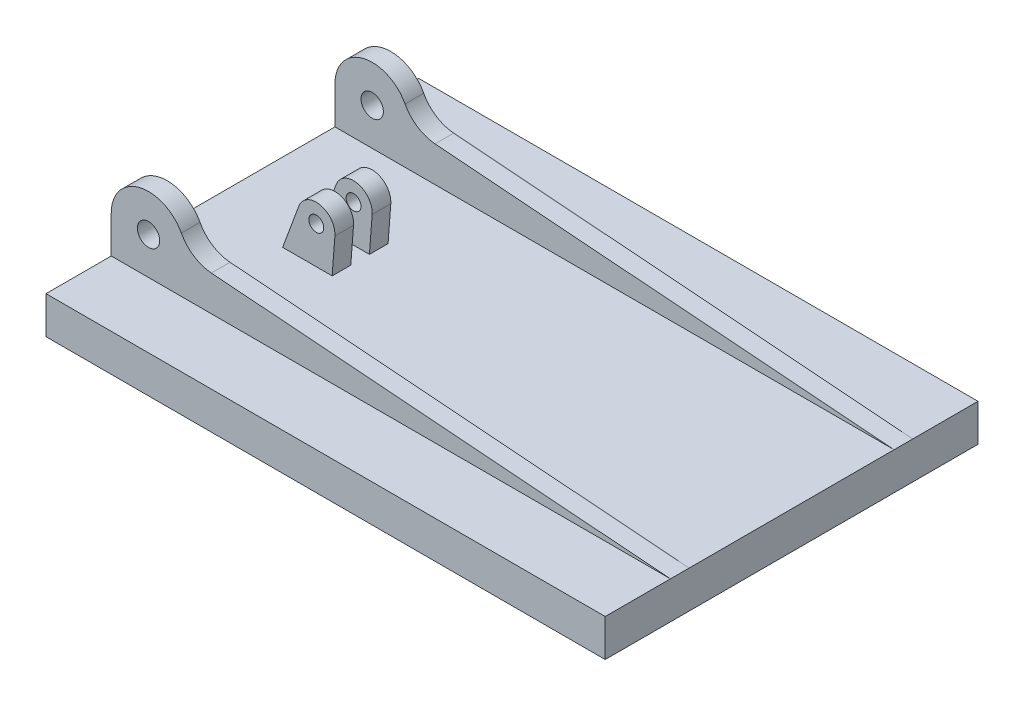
from build123d import *

# Parameters (mm, degrees)
ESQUISSE1_W             = 1500
ESQUISSE1_H             = 1000
BOSS_EXTRU_1_DEPTH      = 100
BOSS_EXTRU_2_DEPTH      = 25
ESQUISSE3_R             = 30
ENL_V_MAT_EXTRU_1_DEPTH = 1724.550115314
CONG_1_R                = 100
ESQUISSE4_R             = 20
BOSS_EXTRU_3_DEPTH      = 25


with BuildPart() as part:
    # Esquisse1 → Boss.-Extru.1 (new body)
    with BuildSketch(Plane(origin=(0, 0, 0), x_dir=(1, 0, 0), z_dir=(0, 1, 0))):
        with Locations((750, 0)):
            Rectangle(ESQUISSE1_W, ESQUISSE1_H)
    extrude(amount=-BOSS_EXTRU_1_DEPTH)

    # Esquisse2 → Boss.-Extru.2 (add, symmetric)
    with BuildSketch(Plane.XY.offset(-300)):
        with BuildLine():
            Line((0, 100), (0, 0))
            Line((0, 0), (1500, 0))
            Line((1500, 0), (200, 100))
            ThreePointArc((200, 100), (100, 200), (0, 100))
        make_face()
    boss_extru_2 = extrude(amount=BOSS_EXTRU_2_DEPTH, both=True)

    # Sym_trie1: Boss.-Extru.2 across plane
    add(boss_extru_2.mirror(Plane.XY))

    # Esquisse3 → Enl_v. mat.-Extru.1 (cut, through all)
    with BuildSketch(Plane.XY.offset(325)):
        with Locations((100, 100)):
            Circle(ESQUISSE3_R)
    extrude(amount=-ENL_V_MAT_EXTRU_1_DEPTH, mode=Mode.SUBTRACT)

    # Cong_1
    cong_1_edges = [part.edges().sort_by_distance(p)[0] for p in [
        (200, 100, -300),
        (200, 100, 300),
    ]]
    fillet(cong_1_edges, radius=CONG_1_R)

    # Esquisse4 → Boss.-Extru.3 (add, symmetric)
    with BuildSketch(Plane.XY.offset(50)):
        with BuildLine():
            Line((209.766581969, 0), (253.096594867, 117.322545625))
            ThreePointArc((253.096594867, 117.322545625), (310.655418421, 148.851428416), (349.85670941, 96.217338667))
            Line((349.85670941, 96.217338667), (342.556636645, 0))
            Line((342.556636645, 0), (209.766581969, 0))
        make_face()
        with Locations((300, 100)):
            Circle(ESQUISSE4_R, mode=Mode.SUBTRACT)
    boss_extru_3 = extrude(amount=BOSS_EXTRU_3_DEPTH, both=True)

    # Sym_trie2: Boss.-Extru.3 across plane
    add(boss_extru_3.mirror(Plane.XY))


solid = part.part
